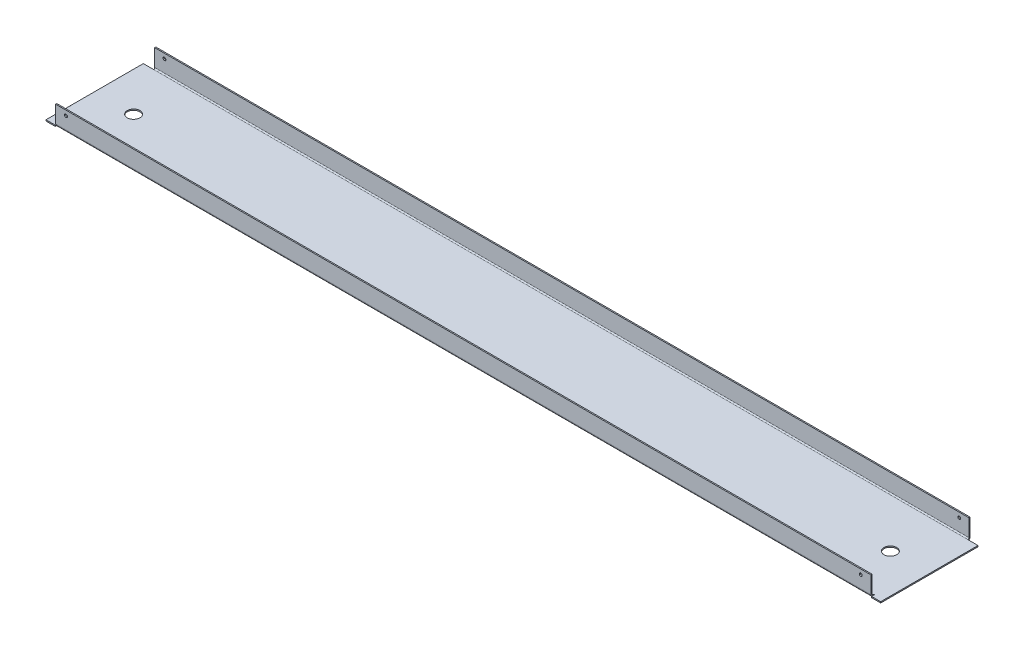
ISO-10303-21;
HEADER;
FILE_DESCRIPTION(('STEP AP214'),'2;1');
FILE_NAME('part.step','',(''),(''),'','','');
FILE_SCHEMA(('AUTOMOTIVE_DESIGN { 1 0 10303 214 1 1 1 1 }'));
ENDSEC;
DATA;
#1=APPLICATION_CONTEXT('core data for automotive mechanical design processes');
#2=APPLICATION_PROTOCOL_DEFINITION('international standard','automotive_design',2000,#1);
#3=PRODUCT_CONTEXT('',#1,'mechanical');
#4=PRODUCT('Part','Part','',(#3));
#5=PRODUCT_RELATED_PRODUCT_CATEGORY('part','',(#4));
#6=PRODUCT_DEFINITION_FORMATION('','',#4);
#7=PRODUCT_DEFINITION_CONTEXT('part definition',#1,'design');
#8=PRODUCT_DEFINITION('design','',#6,#7);
#9=PRODUCT_DEFINITION_SHAPE('','',#8);
#10=(LENGTH_UNIT() NAMED_UNIT(*) SI_UNIT(.MILLI.,.METRE.));
#11=(NAMED_UNIT(*) PLANE_ANGLE_UNIT() SI_UNIT($,.RADIAN.));
#12=(NAMED_UNIT(*) SI_UNIT($,.STERADIAN.) SOLID_ANGLE_UNIT());
#13=UNCERTAINTY_MEASURE_WITH_UNIT(LENGTH_MEASURE(1.E-05),#10,'distance_accuracy_value','');
#14=(GEOMETRIC_REPRESENTATION_CONTEXT(3) GLOBAL_UNCERTAINTY_ASSIGNED_CONTEXT((#13)) GLOBAL_UNIT_ASSIGNED_CONTEXT((#10,
#11,#12)) REPRESENTATION_CONTEXT('',''));
#15=CARTESIAN_POINT('',(0.,0.,0.));
#16=DIRECTION('',(0.,0.,1.));
#17=DIRECTION('',(1.,0.,0.));
#18=AXIS2_PLACEMENT_3D('',#15,#16,#17);
#19=CARTESIAN_POINT('',(0.,-334.3,-1.10551784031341E-12));
#20=DIRECTION('',(0.,1.,0.));
#21=DIRECTION('',(0.,0.,1.));
#22=AXIS2_PLACEMENT_3D('',#19,#20,#21);
#23=PLANE('',#22);
#24=CARTESIAN_POINT('',(388.5,-334.3,52.3499999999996));
#25=DIRECTION('',(0.,-1.,0.));
#26=DIRECTION('',(0.,0.,-1.));
#27=AXIS2_PLACEMENT_3D('',#24,#25,#26);
#28=CIRCLE('',#27,6.50000000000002);
#29=CARTESIAN_POINT('',(388.5,-334.3,45.8499999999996));
#30=VERTEX_POINT('',#29);
#31=EDGE_CURVE('E874',#30,#30,#28,.T.);
#32=ORIENTED_EDGE('',*,*,#31,.F.);
#33=EDGE_LOOP('',(#32));
#34=FACE_BOUND('',#33,.T.);
#35=CARTESIAN_POINT('',(-388.5,-334.3,52.3499999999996));
#36=DIRECTION('',(0.,-1.,0.));
#37=DIRECTION('',(0.,0.,-1.));
#38=AXIS2_PLACEMENT_3D('',#35,#36,#37);
#39=CIRCLE('',#38,6.50000000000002);
#40=CARTESIAN_POINT('',(-388.5,-334.3,45.8499999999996));
#41=VERTEX_POINT('',#40);
#42=EDGE_CURVE('E879',#41,#41,#39,.T.);
#43=ORIENTED_EDGE('',*,*,#42,.F.);
#44=EDGE_LOOP('',(#43));
#45=FACE_BOUND('',#44,.T.);
#46=DIRECTION('',(0.,0.,1.));
#47=VECTOR('',#46,1.);
#48=CARTESIAN_POINT('',(419.1,-334.3,-1.10551784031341E-12));
#49=LINE('',#48,#47);
#50=CARTESIAN_POINT('',(419.1,-334.3,99.3));
#51=VERTEX_POINT('',#50);
#52=CARTESIAN_POINT('',(419.1,-334.3,102.3));
#53=VERTEX_POINT('',#52);
#54=EDGE_CURVE('E94',#51,#53,#49,.T.);
#55=ORIENTED_EDGE('',*,*,#54,.F.);
#56=DIRECTION('',(1.,0.,0.));
#57=VECTOR('',#56,1.);
#58=CARTESIAN_POINT('',(0.,-334.3,99.3));
#59=LINE('',#58,#57);
#60=CARTESIAN_POINT('',(418.5,-334.3,99.3));
#61=VERTEX_POINT('',#60);
#62=EDGE_CURVE('E98',#61,#51,#59,.T.);
#63=ORIENTED_EDGE('',*,*,#62,.F.);
#64=DIRECTION('',(0.,0.,-1.));
#65=VECTOR('',#64,1.);
#66=CARTESIAN_POINT('',(418.5,-334.3,-1.10551784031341E-12));
#67=LINE('',#66,#65);
#68=CARTESIAN_POINT('',(418.5,-334.300000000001,99.9));
#69=VERTEX_POINT('',#68);
#70=EDGE_CURVE('E343',#69,#61,#67,.T.);
#71=ORIENTED_EDGE('',*,*,#70,.F.);
#72=DIRECTION('',(1.,0.,0.));
#73=VECTOR('',#72,1.);
#74=CARTESIAN_POINT('',(418.5,-334.300000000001,99.9));
#75=LINE('',#74,#73);
#76=CARTESIAN_POINT('',(-418.5,-334.3,99.9));
#77=VERTEX_POINT('',#76);
#78=EDGE_CURVE('E235',#69,#77,#75,.F.);
#79=ORIENTED_EDGE('',*,*,#78,.T.);
#80=DIRECTION('',(0.,0.,1.));
#81=VECTOR('',#80,1.);
#82=CARTESIAN_POINT('',(-418.5,-334.3,-1.10551784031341E-12));
#83=LINE('',#82,#81);
#84=CARTESIAN_POINT('',(-418.5,-334.3,99.3));
#85=VERTEX_POINT('',#84);
#86=EDGE_CURVE('E340',#85,#77,#83,.T.);
#87=ORIENTED_EDGE('',*,*,#86,.F.);
#88=DIRECTION('',(1.,0.,0.));
#89=VECTOR('',#88,1.);
#90=CARTESIAN_POINT('',(0.,-334.3,99.3));
#91=LINE('',#90,#89);
#92=CARTESIAN_POINT('',(-419.1,-334.3,99.3));
#93=VERTEX_POINT('',#92);
#94=EDGE_CURVE('E337',#93,#85,#91,.T.);
#95=ORIENTED_EDGE('',*,*,#94,.F.);
#96=DIRECTION('',(0.,0.,-1.));
#97=VECTOR('',#96,1.);
#98=CARTESIAN_POINT('',(-419.1,-334.3,-1.10551784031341E-12));
#99=LINE('',#98,#97);
#100=CARTESIAN_POINT('',(-419.1,-334.3,102.3));
#101=VERTEX_POINT('',#100);
#102=EDGE_CURVE('E302',#101,#93,#99,.T.);
#103=ORIENTED_EDGE('',*,*,#102,.F.);
#104=DIRECTION('',(-1.,0.,0.));
#105=VECTOR('',#104,1.);
#106=CARTESIAN_POINT('',(0.,-334.3,102.3));
#107=LINE('',#106,#105);
#108=CARTESIAN_POINT('',(-428.5,-334.3,102.3));
#109=VERTEX_POINT('',#108);
#110=EDGE_CURVE('E356',#101,#109,#107,.T.);
#111=ORIENTED_EDGE('',*,*,#110,.T.);
#112=DIRECTION('',(0.,0.,-1.));
#113=VECTOR('',#112,1.);
#114=CARTESIAN_POINT('',(-428.5,-334.3,-1.10551784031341E-12));
#115=LINE('',#114,#113);
#116=CARTESIAN_POINT('',(-428.5,-334.3,2.39999999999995));
#117=VERTEX_POINT('',#116);
#118=EDGE_CURVE('E359',#109,#117,#115,.T.);
#119=ORIENTED_EDGE('',*,*,#118,.T.);
#120=DIRECTION('',(1.,0.,0.));
#121=VECTOR('',#120,1.);
#122=CARTESIAN_POINT('',(-428.5,-334.3,2.39999999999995));
#123=LINE('',#122,#121);
#124=CARTESIAN_POINT('',(-418.,-334.3,2.39999999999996));
#125=VERTEX_POINT('',#124);
#126=EDGE_CURVE('E374',#125,#117,#123,.F.);
#127=ORIENTED_EDGE('',*,*,#126,.F.);
#128=DIRECTION('',(1.,0.,0.));
#129=VECTOR('',#128,1.);
#130=CARTESIAN_POINT('',(418.,-334.3,2.40000000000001));
#131=LINE('',#130,#129);
#132=CARTESIAN_POINT('',(418.,-334.3,2.40000000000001));
#133=VERTEX_POINT('',#132);
#134=EDGE_CURVE('E389',#125,#133,#131,.T.);
#135=ORIENTED_EDGE('',*,*,#134,.T.);
#136=CARTESIAN_POINT('',(428.5,-334.3,2.40000000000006));
#137=VERTEX_POINT('',#136);
#138=EDGE_CURVE('E371',#137,#133,#123,.F.);
#139=ORIENTED_EDGE('',*,*,#138,.F.);
#140=DIRECTION('',(0.,0.,1.));
#141=VECTOR('',#140,1.);
#142=CARTESIAN_POINT('',(428.5,-334.3,-1.10551784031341E-12));
#143=LINE('',#142,#141);
#144=CARTESIAN_POINT('',(428.5,-334.3,102.3));
#145=VERTEX_POINT('',#144);
#146=EDGE_CURVE('E357',#137,#145,#143,.T.);
#147=ORIENTED_EDGE('',*,*,#146,.T.);
#148=EDGE_CURVE('E354',#145,#53,#107,.T.);
#149=ORIENTED_EDGE('',*,*,#148,.T.);
#150=EDGE_LOOP('',(#55,#63,#71,#79,#87,#95,#103,#111,#119,#127,#135,#139,#147,#149));
#151=FACE_BOUND('',#150,.T.);
#152=ADVANCED_FACE('F77',(#34,#45,#151),#23,.F.);
#153=CARTESIAN_POINT('',(0.,-333.1,-1.10132806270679E-12));
#154=DIRECTION('',(0.,1.,0.));
#155=DIRECTION('',(0.,0.,1.));
#156=AXIS2_PLACEMENT_3D('',#153,#154,#155);
#157=PLANE('',#156);
#158=CARTESIAN_POINT('',(388.5,-333.1,52.3499999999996));
#159=DIRECTION('',(0.,-1.,0.));
#160=DIRECTION('',(0.,0.,-1.));
#161=AXIS2_PLACEMENT_3D('',#158,#159,#160);
#162=CIRCLE('',#161,6.50000000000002);
#163=CARTESIAN_POINT('',(388.5,-333.1,45.8499999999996));
#164=VERTEX_POINT('',#163);
#165=EDGE_CURVE('E449',#164,#164,#162,.T.);
#166=ORIENTED_EDGE('',*,*,#165,.T.);
#167=EDGE_LOOP('',(#166));
#168=FACE_BOUND('',#167,.T.);
#169=CARTESIAN_POINT('',(-388.5,-333.1,52.3499999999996));
#170=DIRECTION('',(0.,-1.,0.));
#171=DIRECTION('',(0.,0.,-1.));
#172=AXIS2_PLACEMENT_3D('',#169,#170,#171);
#173=CIRCLE('',#172,6.50000000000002);
#174=CARTESIAN_POINT('',(-388.5,-333.1,45.8499999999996));
#175=VERTEX_POINT('',#174);
#176=EDGE_CURVE('E875',#175,#175,#173,.T.);
#177=ORIENTED_EDGE('',*,*,#176,.T.);
#178=EDGE_LOOP('',(#177));
#179=FACE_BOUND('',#178,.T.);
#180=DIRECTION('',(-1.,0.,0.));
#181=VECTOR('',#180,1.);
#182=CARTESIAN_POINT('',(419.1,-333.100000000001,99.3));
#183=LINE('',#182,#181);
#184=CARTESIAN_POINT('',(419.1,-333.1,99.3));
#185=VERTEX_POINT('',#184);
#186=CARTESIAN_POINT('',(418.5,-333.1,99.3));
#187=VERTEX_POINT('',#186);
#188=EDGE_CURVE('E304',#185,#187,#183,.T.);
#189=ORIENTED_EDGE('',*,*,#188,.F.);
#190=DIRECTION('',(0.,0.,-1.));
#191=VECTOR('',#190,1.);
#192=CARTESIAN_POINT('',(419.1,-333.1,102.3));
#193=LINE('',#192,#191);
#194=CARTESIAN_POINT('',(419.1,-333.1,102.3));
#195=VERTEX_POINT('',#194);
#196=EDGE_CURVE('E299',#195,#185,#193,.T.);
#197=ORIENTED_EDGE('',*,*,#196,.F.);
#198=DIRECTION('',(1.,0.,0.));
#199=VECTOR('',#198,1.);
#200=CARTESIAN_POINT('',(-428.5,-333.1,102.3));
#201=LINE('',#200,#199);
#202=CARTESIAN_POINT('',(428.5,-333.1,102.3));
#203=VERTEX_POINT('',#202);
#204=EDGE_CURVE('E362',#203,#195,#201,.F.);
#205=ORIENTED_EDGE('',*,*,#204,.F.);
#206=DIRECTION('',(0.,0.,-1.));
#207=VECTOR('',#206,1.);
#208=CARTESIAN_POINT('',(428.5,-333.1,102.3));
#209=LINE('',#208,#207);
#210=CARTESIAN_POINT('',(428.5,-333.1,2.40000000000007));
#211=VERTEX_POINT('',#210);
#212=EDGE_CURVE('E366',#211,#203,#209,.F.);
#213=ORIENTED_EDGE('',*,*,#212,.F.);
#214=DIRECTION('',(1.,0.,0.));
#215=VECTOR('',#214,1.);
#216=CARTESIAN_POINT('',(-428.5,-333.1,2.39999999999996));
#217=LINE('',#216,#215);
#218=CARTESIAN_POINT('',(418.,-333.1,2.40000000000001));
#219=VERTEX_POINT('',#218);
#220=EDGE_CURVE('E380',#219,#211,#217,.T.);
#221=ORIENTED_EDGE('',*,*,#220,.F.);
#222=DIRECTION('',(1.,0.,0.));
#223=VECTOR('',#222,1.);
#224=CARTESIAN_POINT('',(418.,-333.1,2.40000000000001));
#225=LINE('',#224,#223);
#226=CARTESIAN_POINT('',(-418.,-333.1,2.40000000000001));
#227=VERTEX_POINT('',#226);
#228=EDGE_CURVE('E350',#227,#219,#225,.T.);
#229=ORIENTED_EDGE('',*,*,#228,.F.);
#230=CARTESIAN_POINT('',(-428.5,-333.1,2.39999999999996));
#231=VERTEX_POINT('',#230);
#232=EDGE_CURVE('E377',#231,#227,#217,.T.);
#233=ORIENTED_EDGE('',*,*,#232,.F.);
#234=DIRECTION('',(0.,0.,1.));
#235=VECTOR('',#234,1.);
#236=CARTESIAN_POINT('',(-428.5,-333.1,1.2));
#237=LINE('',#236,#235);
#238=CARTESIAN_POINT('',(-428.5,-333.1,102.3));
#239=VERTEX_POINT('',#238);
#240=EDGE_CURVE('E368',#239,#231,#237,.F.);
#241=ORIENTED_EDGE('',*,*,#240,.F.);
#242=CARTESIAN_POINT('',(-419.1,-333.1,102.3));
#243=VERTEX_POINT('',#242);
#244=EDGE_CURVE('E365',#243,#239,#201,.F.);
#245=ORIENTED_EDGE('',*,*,#244,.F.);
#246=DIRECTION('',(0.,0.,1.));
#247=VECTOR('',#246,1.);
#248=CARTESIAN_POINT('',(-419.1,-333.100000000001,99.3));
#249=LINE('',#248,#247);
#250=CARTESIAN_POINT('',(-419.1,-333.1,99.3));
#251=VERTEX_POINT('',#250);
#252=EDGE_CURVE('E319',#251,#243,#249,.T.);
#253=ORIENTED_EDGE('',*,*,#252,.F.);
#254=DIRECTION('',(-1.,0.,0.));
#255=VECTOR('',#254,1.);
#256=CARTESIAN_POINT('',(-418.5,-333.100000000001,99.3));
#257=LINE('',#256,#255);
#258=CARTESIAN_POINT('',(-418.5,-333.1,99.3));
#259=VERTEX_POINT('',#258);
#260=EDGE_CURVE('E315',#259,#251,#257,.T.);
#261=ORIENTED_EDGE('',*,*,#260,.F.);
#262=DIRECTION('',(0.,0.,-1.));
#263=VECTOR('',#262,1.);
#264=CARTESIAN_POINT('',(-418.5,-333.100000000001,99.9));
#265=LINE('',#264,#263);
#266=CARTESIAN_POINT('',(-418.5,-333.1,99.9));
#267=VERTEX_POINT('',#266);
#268=EDGE_CURVE('E312',#267,#259,#265,.T.);
#269=ORIENTED_EDGE('',*,*,#268,.F.);
#270=DIRECTION('',(1.,0.,0.));
#271=VECTOR('',#270,1.);
#272=CARTESIAN_POINT('',(418.5,-333.100000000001,99.9));
#273=LINE('',#272,#271);
#274=CARTESIAN_POINT('',(418.5,-333.1,99.9));
#275=VERTEX_POINT('',#274);
#276=EDGE_CURVE('E290',#275,#267,#273,.F.);
#277=ORIENTED_EDGE('',*,*,#276,.F.);
#278=DIRECTION('',(0.,0.,1.));
#279=VECTOR('',#278,1.);
#280=CARTESIAN_POINT('',(418.5,-333.100000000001,99.3));
#281=LINE('',#280,#279);
#282=EDGE_CURVE('E308',#187,#275,#281,.T.);
#283=ORIENTED_EDGE('',*,*,#282,.F.);
#284=EDGE_LOOP('',(#189,#197,#205,#213,#221,#229,#233,#241,#245,#253,#261,#269,#277,#283));
#285=FACE_BOUND('',#284,.T.);
#286=ADVANCED_FACE('F469',(#168,#179,#285),#157,.T.);
#287=CARTESIAN_POINT('',(-428.5,-334.3,102.3));
#288=DIRECTION('',(0.,0.,-1.));
#289=DIRECTION('',(0.,1.,0.));
#290=AXIS2_PLACEMENT_3D('',#287,#288,#289);
#291=PLANE('',#290);
#292=DIRECTION('',(0.,-1.,0.));
#293=VECTOR('',#292,1.);
#294=CARTESIAN_POINT('',(419.1,-333.1,102.3));
#295=LINE('',#294,#293);
#296=EDGE_CURVE('E303',#195,#53,#295,.T.);
#297=ORIENTED_EDGE('',*,*,#296,.T.);
#298=ORIENTED_EDGE('',*,*,#148,.F.);
#299=DIRECTION('',(0.,1.,0.));
#300=VECTOR('',#299,1.);
#301=CARTESIAN_POINT('',(428.5,-334.3,102.3));
#302=LINE('',#301,#300);
#303=EDGE_CURVE('E347',#145,#203,#302,.T.);
#304=ORIENTED_EDGE('',*,*,#303,.T.);
#305=ORIENTED_EDGE('',*,*,#204,.T.);
#306=EDGE_LOOP('',(#297,#298,#304,#305));
#307=FACE_BOUND('',#306,.T.);
#308=ADVANCED_FACE('F482',(#307),#291,.F.);
#309=DIRECTION('',(0.,-1.,0.));
#310=VECTOR('',#309,1.);
#311=CARTESIAN_POINT('',(-419.1,-333.1,102.3));
#312=LINE('',#311,#310);
#313=EDGE_CURVE('E322',#243,#101,#312,.T.);
#314=ORIENTED_EDGE('',*,*,#313,.F.);
#315=ORIENTED_EDGE('',*,*,#244,.T.);
#316=DIRECTION('',(0.,1.,0.));
#317=VECTOR('',#316,1.);
#318=CARTESIAN_POINT('',(-428.5,-334.3,102.3));
#319=LINE('',#318,#317);
#320=EDGE_CURVE('E351',#109,#239,#319,.T.);
#321=ORIENTED_EDGE('',*,*,#320,.F.);
#322=ORIENTED_EDGE('',*,*,#110,.F.);
#323=EDGE_LOOP('',(#314,#315,#321,#322));
#324=FACE_BOUND('',#323,.T.);
#325=ADVANCED_FACE('F515',(#324),#291,.F.);
#326=CARTESIAN_POINT('',(-418.,-314.3,1.2));
#327=DIRECTION('',(1.,0.,0.));
#328=DIRECTION('',(0.,1.,0.));
#329=AXIS2_PLACEMENT_3D('',#326,#327,#328);
#330=PLANE('',#329);
#331=DIRECTION('',(0.,0.,-1.));
#332=VECTOR('',#331,1.);
#333=CARTESIAN_POINT('',(-418.,-331.9,1.20000000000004));
#334=LINE('',#333,#332);
#335=CARTESIAN_POINT('',(-418.,-331.9,1.2));
#336=VERTEX_POINT('',#335);
#337=CARTESIAN_POINT('',(-418.,-331.9,0.));
#338=VERTEX_POINT('',#337);
#339=EDGE_CURVE('E404',#336,#338,#334,.T.);
#340=ORIENTED_EDGE('',*,*,#339,.F.);
#341=DIRECTION('',(0.,-1.,0.));
#342=VECTOR('',#341,1.);
#343=CARTESIAN_POINT('',(-418.,-314.3,1.2));
#344=LINE('',#343,#342);
#345=CARTESIAN_POINT('',(-418.,-314.3,1.2));
#346=VERTEX_POINT('',#345);
#347=EDGE_CURVE('E414',#346,#336,#344,.T.);
#348=ORIENTED_EDGE('',*,*,#347,.F.);
#349=DIRECTION('',(0.,0.,-1.));
#350=VECTOR('',#349,1.);
#351=CARTESIAN_POINT('',(-418.,-314.3,1.2));
#352=LINE('',#351,#350);
#353=CARTESIAN_POINT('',(-418.,-314.3,0.));
#354=VERTEX_POINT('',#353);
#355=EDGE_CURVE('E86',#346,#354,#352,.T.);
#356=ORIENTED_EDGE('',*,*,#355,.T.);
#357=DIRECTION('',(0.,-1.,0.));
#358=VECTOR('',#357,1.);
#359=CARTESIAN_POINT('',(-418.,-314.3,0.));
#360=LINE('',#359,#358);
#361=EDGE_CURVE('E412',#354,#338,#360,.T.);
#362=ORIENTED_EDGE('',*,*,#361,.T.);
#363=EDGE_LOOP('',(#340,#348,#356,#362));
#364=FACE_BOUND('',#363,.T.);
#365=ADVANCED_FACE('F79',(#364),#330,.F.);
#366=CARTESIAN_POINT('',(418.,-314.3,1.2));
#367=DIRECTION('',(-1.,0.,0.));
#368=DIRECTION('',(0.,0.,1.));
#369=AXIS2_PLACEMENT_3D('',#366,#367,#368);
#370=PLANE('',#369);
#371=DIRECTION('',(0.,0.,-1.));
#372=VECTOR('',#371,1.);
#373=CARTESIAN_POINT('',(418.,-331.9,1.20000000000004));
#374=LINE('',#373,#372);
#375=CARTESIAN_POINT('',(418.,-331.9,1.2));
#376=VERTEX_POINT('',#375);
#377=CARTESIAN_POINT('',(418.,-331.9,0.));
#378=VERTEX_POINT('',#377);
#379=EDGE_CURVE('E388',#376,#378,#374,.T.);
#380=ORIENTED_EDGE('',*,*,#379,.T.);
#381=DIRECTION('',(0.,1.,0.));
#382=VECTOR('',#381,1.);
#383=CARTESIAN_POINT('',(418.,-314.3,0.));
#384=LINE('',#383,#382);
#385=CARTESIAN_POINT('',(418.,-314.3,0.));
#386=VERTEX_POINT('',#385);
#387=EDGE_CURVE('E424',#378,#386,#384,.T.);
#388=ORIENTED_EDGE('',*,*,#387,.T.);
#389=DIRECTION('',(0.,0.,-1.));
#390=VECTOR('',#389,1.);
#391=CARTESIAN_POINT('',(418.,-314.3,1.2));
#392=LINE('',#391,#390);
#393=CARTESIAN_POINT('',(418.,-314.3,1.2));
#394=VERTEX_POINT('',#393);
#395=EDGE_CURVE('E13',#394,#386,#392,.T.);
#396=ORIENTED_EDGE('',*,*,#395,.F.);
#397=DIRECTION('',(0.,1.,0.));
#398=VECTOR('',#397,1.);
#399=CARTESIAN_POINT('',(418.,-314.3,1.2));
#400=LINE('',#399,#398);
#401=EDGE_CURVE('E417',#376,#394,#400,.T.);
#402=ORIENTED_EDGE('',*,*,#401,.F.);
#403=EDGE_LOOP('',(#380,#388,#396,#402));
#404=FACE_BOUND('',#403,.T.);
#405=ADVANCED_FACE('F546',(#404),#370,.F.);
#406=CARTESIAN_POINT('',(0.,0.,1.2));
#407=DIRECTION('',(0.,0.,1.));
#408=DIRECTION('',(1.,0.,0.));
#409=AXIS2_PLACEMENT_3D('',#406,#407,#408);
#410=PLANE('',#409);
#411=CARTESIAN_POINT('',(-408.,-319.3,1.2));
#412=DIRECTION('',(0.,0.,1.));
#413=DIRECTION('',(1.,0.,0.));
#414=AXIS2_PLACEMENT_3D('',#411,#412,#413);
#415=CIRCLE('',#414,1.50000000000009);
#416=CARTESIAN_POINT('',(-406.5,-319.3,1.2));
#417=VERTEX_POINT('',#416);
#418=EDGE_CURVE('E283',#417,#417,#415,.T.);
#419=ORIENTED_EDGE('',*,*,#418,.F.);
#420=EDGE_LOOP('',(#419));
#421=FACE_BOUND('',#420,.T.);
#422=CARTESIAN_POINT('',(408.,-319.3,1.2));
#423=DIRECTION('',(0.,0.,1.));
#424=DIRECTION('',(1.,0.,0.));
#425=AXIS2_PLACEMENT_3D('',#422,#423,#424);
#426=CIRCLE('',#425,1.50000000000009);
#427=CARTESIAN_POINT('',(409.5,-319.3,1.2));
#428=VERTEX_POINT('',#427);
#429=EDGE_CURVE('E430',#428,#428,#426,.T.);
#430=ORIENTED_EDGE('',*,*,#429,.F.);
#431=EDGE_LOOP('',(#430));
#432=FACE_BOUND('',#431,.T.);
#433=ORIENTED_EDGE('',*,*,#347,.T.);
#434=DIRECTION('',(1.,0.,0.));
#435=VECTOR('',#434,1.);
#436=CARTESIAN_POINT('',(418.,-331.9,1.20000000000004));
#437=LINE('',#436,#435);
#438=EDGE_CURVE('E397',#376,#336,#437,.F.);
#439=ORIENTED_EDGE('',*,*,#438,.F.);
#440=ORIENTED_EDGE('',*,*,#401,.T.);
#441=DIRECTION('',(-1.,0.,0.));
#442=VECTOR('',#441,1.);
#443=CARTESIAN_POINT('',(-418.,-314.3,1.2));
#444=LINE('',#443,#442);
#445=EDGE_CURVE('E420',#394,#346,#444,.T.);
#446=ORIENTED_EDGE('',*,*,#445,.T.);
#447=EDGE_LOOP('',(#433,#439,#440,#446));
#448=FACE_BOUND('',#447,.T.);
#449=ADVANCED_FACE('F542',(#421,#432,#448),#410,.T.);
#450=CARTESIAN_POINT('',(0.,0.,0.));
#451=DIRECTION('',(0.,0.,1.));
#452=DIRECTION('',(1.,0.,0.));
#453=AXIS2_PLACEMENT_3D('',#450,#451,#452);
#454=PLANE('',#453);
#455=CARTESIAN_POINT('',(-408.,-319.3,0.));
#456=DIRECTION('',(0.,0.,1.));
#457=DIRECTION('',(1.,0.,0.));
#458=AXIS2_PLACEMENT_3D('',#455,#456,#457);
#459=CIRCLE('',#458,1.50000000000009);
#460=CARTESIAN_POINT('',(-406.5,-319.3,0.));
#461=VERTEX_POINT('',#460);
#462=EDGE_CURVE('E431',#461,#461,#459,.T.);
#463=ORIENTED_EDGE('',*,*,#462,.T.);
#464=EDGE_LOOP('',(#463));
#465=FACE_BOUND('',#464,.T.);
#466=CARTESIAN_POINT('',(408.,-319.3,0.));
#467=DIRECTION('',(0.,0.,1.));
#468=DIRECTION('',(1.,0.,0.));
#469=AXIS2_PLACEMENT_3D('',#466,#467,#468);
#470=CIRCLE('',#469,1.50000000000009);
#471=CARTESIAN_POINT('',(409.5,-319.3,0.));
#472=VERTEX_POINT('',#471);
#473=EDGE_CURVE('E442',#472,#472,#470,.T.);
#474=ORIENTED_EDGE('',*,*,#473,.T.);
#475=EDGE_LOOP('',(#474));
#476=FACE_BOUND('',#475,.T.);
#477=DIRECTION('',(1.,0.,0.));
#478=VECTOR('',#477,1.);
#479=CARTESIAN_POINT('',(418.,-331.9,0.));
#480=LINE('',#479,#478);
#481=EDGE_CURVE('E383',#378,#338,#480,.F.);
#482=ORIENTED_EDGE('',*,*,#481,.T.);
#483=ORIENTED_EDGE('',*,*,#361,.F.);
#484=DIRECTION('',(-1.,0.,0.));
#485=VECTOR('',#484,1.);
#486=CARTESIAN_POINT('',(-418.,-314.3,0.));
#487=LINE('',#486,#485);
#488=EDGE_CURVE('E418',#386,#354,#487,.T.);
#489=ORIENTED_EDGE('',*,*,#488,.F.);
#490=ORIENTED_EDGE('',*,*,#387,.F.);
#491=EDGE_LOOP('',(#482,#483,#489,#490));
#492=FACE_BOUND('',#491,.T.);
#493=ADVANCED_FACE('F545',(#465,#476,#492),#454,.F.);
#494=CARTESIAN_POINT('',(-418.,-314.3,1.2));
#495=DIRECTION('',(0.,-1.,0.));
#496=DIRECTION('',(0.,0.,-1.));
#497=AXIS2_PLACEMENT_3D('',#494,#495,#496);
#498=PLANE('',#497);
#499=ORIENTED_EDGE('',*,*,#488,.T.);
#500=ORIENTED_EDGE('',*,*,#355,.F.);
#501=ORIENTED_EDGE('',*,*,#445,.F.);
#502=ORIENTED_EDGE('',*,*,#395,.T.);
#503=EDGE_LOOP('',(#499,#500,#501,#502));
#504=FACE_BOUND('',#503,.T.);
#505=ADVANCED_FACE('F537',(#504),#498,.F.);
#506=CARTESIAN_POINT('',(-418.,-331.9,2.40000000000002));
#507=DIRECTION('',(-1.,0.,0.));
#508=DIRECTION('',(0.,0.,1.));
#509=AXIS2_PLACEMENT_3D('',#506,#507,#508);
#510=PLANE('',#509);
#511=DIRECTION('',(0.,-1.,0.));
#512=VECTOR('',#511,1.);
#513=CARTESIAN_POINT('',(-418.,-333.1,2.40000000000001));
#514=LINE('',#513,#512);
#515=EDGE_CURVE('E407',#227,#125,#514,.T.);
#516=ORIENTED_EDGE('',*,*,#515,.F.);
#517=CARTESIAN_POINT('',(-418.,-331.9,2.40000000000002));
#518=DIRECTION('',(1.,0.,0.));
#519=DIRECTION('',(0.,0.,-1.));
#520=AXIS2_PLACEMENT_3D('',#517,#518,#519);
#521=CIRCLE('',#520,1.19999999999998);
#522=EDGE_CURVE('E392',#336,#227,#521,.F.);
#523=ORIENTED_EDGE('',*,*,#522,.F.);
#524=ORIENTED_EDGE('',*,*,#339,.T.);
#525=CARTESIAN_POINT('',(-418.,-331.9,2.40000000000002));
#526=DIRECTION('',(1.,0.,0.));
#527=DIRECTION('',(0.,0.,-1.));
#528=AXIS2_PLACEMENT_3D('',#525,#526,#527);
#529=CIRCLE('',#528,2.39999999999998);
#530=EDGE_CURVE('E385',#338,#125,#529,.F.);
#531=ORIENTED_EDGE('',*,*,#530,.T.);
#532=EDGE_LOOP('',(#516,#523,#524,#531));
#533=FACE_BOUND('',#532,.T.);
#534=ADVANCED_FACE('F534',(#533),#510,.T.);
#535=CARTESIAN_POINT('',(418.,-331.9,2.40000000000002));
#536=DIRECTION('',(-1.,0.,0.));
#537=DIRECTION('',(0.,0.,1.));
#538=AXIS2_PLACEMENT_3D('',#535,#536,#537);
#539=PLANE('',#538);
#540=CARTESIAN_POINT('',(418.,-331.9,2.40000000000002));
#541=DIRECTION('',(1.,0.,0.));
#542=DIRECTION('',(0.,0.,-1.));
#543=AXIS2_PLACEMENT_3D('',#540,#541,#542);
#544=CIRCLE('',#543,1.19999999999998);
#545=EDGE_CURVE('E400',#219,#376,#544,.T.);
#546=ORIENTED_EDGE('',*,*,#545,.F.);
#547=DIRECTION('',(0.,-1.,0.));
#548=VECTOR('',#547,1.);
#549=CARTESIAN_POINT('',(418.,-333.1,2.40000000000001));
#550=LINE('',#549,#548);
#551=EDGE_CURVE('E410',#219,#133,#550,.T.);
#552=ORIENTED_EDGE('',*,*,#551,.T.);
#553=CARTESIAN_POINT('',(418.,-331.9,2.40000000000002));
#554=DIRECTION('',(1.,0.,0.));
#555=DIRECTION('',(0.,0.,-1.));
#556=AXIS2_PLACEMENT_3D('',#553,#554,#555);
#557=CIRCLE('',#556,2.39999999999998);
#558=EDGE_CURVE('E386',#133,#378,#557,.T.);
#559=ORIENTED_EDGE('',*,*,#558,.T.);
#560=ORIENTED_EDGE('',*,*,#379,.F.);
#561=EDGE_LOOP('',(#546,#552,#559,#560));
#562=FACE_BOUND('',#561,.T.);
#563=ADVANCED_FACE('F529',(#562),#539,.F.);
#564=CARTESIAN_POINT('',(418.,-331.9,2.40000000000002));
#565=DIRECTION('',(1.,0.,0.));
#566=DIRECTION('',(0.,-1.,0.));
#567=AXIS2_PLACEMENT_3D('',#564,#565,#566);
#568=CYLINDRICAL_SURFACE('',#567,2.39999999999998);
#569=ORIENTED_EDGE('',*,*,#481,.F.);
#570=ORIENTED_EDGE('',*,*,#558,.F.);
#571=ORIENTED_EDGE('',*,*,#134,.F.);
#572=ORIENTED_EDGE('',*,*,#530,.F.);
#573=EDGE_LOOP('',(#569,#570,#571,#572));
#574=FACE_BOUND('',#573,.T.);
#575=ADVANCED_FACE('F525',(#574),#568,.T.);
#576=CARTESIAN_POINT('',(418.,-331.9,2.40000000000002));
#577=DIRECTION('',(1.,0.,0.));
#578=DIRECTION('',(0.,-1.,0.));
#579=AXIS2_PLACEMENT_3D('',#576,#577,#578);
#580=CYLINDRICAL_SURFACE('',#579,1.19999999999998);
#581=ORIENTED_EDGE('',*,*,#438,.T.);
#582=ORIENTED_EDGE('',*,*,#522,.T.);
#583=ORIENTED_EDGE('',*,*,#228,.T.);
#584=ORIENTED_EDGE('',*,*,#545,.T.);
#585=EDGE_LOOP('',(#581,#582,#583,#584));
#586=FACE_BOUND('',#585,.T.);
#587=ADVANCED_FACE('F528',(#586),#580,.F.);
#588=CARTESIAN_POINT('',(-428.5,-333.1,2.39999999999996));
#589=DIRECTION('',(0.,0.,-1.));
#590=DIRECTION('',(0.,1.,0.));
#591=AXIS2_PLACEMENT_3D('',#588,#589,#590);
#592=PLANE('',#591);
#593=ORIENTED_EDGE('',*,*,#551,.F.);
#594=ORIENTED_EDGE('',*,*,#220,.T.);
#595=DIRECTION('',(0.,1.,0.));
#596=VECTOR('',#595,1.);
#597=CARTESIAN_POINT('',(428.5,-333.1,2.40000000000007));
#598=LINE('',#597,#596);
#599=EDGE_CURVE('E375',#211,#137,#598,.F.);
#600=ORIENTED_EDGE('',*,*,#599,.T.);
#601=ORIENTED_EDGE('',*,*,#138,.T.);
#602=EDGE_LOOP('',(#593,#594,#600,#601));
#603=FACE_BOUND('',#602,.T.);
#604=ADVANCED_FACE('F523',(#603),#592,.T.);
#605=CARTESIAN_POINT('',(-428.5,-334.3,1.2));
#606=DIRECTION('',(1.,0.,0.));
#607=DIRECTION('',(0.,0.,-1.));
#608=AXIS2_PLACEMENT_3D('',#605,#606,#607);
#609=PLANE('',#608);
#610=DIRECTION('',(0.,1.,0.));
#611=VECTOR('',#610,1.);
#612=CARTESIAN_POINT('',(-428.5,-334.3,2.39999999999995));
#613=LINE('',#612,#611);
#614=EDGE_CURVE('E346',#231,#117,#613,.F.);
#615=ORIENTED_EDGE('',*,*,#614,.T.);
#616=ORIENTED_EDGE('',*,*,#118,.F.);
#617=ORIENTED_EDGE('',*,*,#320,.T.);
#618=ORIENTED_EDGE('',*,*,#240,.T.);
#619=EDGE_LOOP('',(#615,#616,#617,#618));
#620=FACE_BOUND('',#619,.T.);
#621=ADVANCED_FACE('F519',(#620),#609,.F.);
#622=CARTESIAN_POINT('',(428.5,-334.3,102.3));
#623=DIRECTION('',(-1.,0.,0.));
#624=DIRECTION('',(0.,0.,1.));
#625=AXIS2_PLACEMENT_3D('',#622,#623,#624);
#626=PLANE('',#625);
#627=ORIENTED_EDGE('',*,*,#599,.F.);
#628=ORIENTED_EDGE('',*,*,#212,.T.);
#629=ORIENTED_EDGE('',*,*,#303,.F.);
#630=ORIENTED_EDGE('',*,*,#146,.F.);
#631=EDGE_LOOP('',(#627,#628,#629,#630));
#632=FACE_BOUND('',#631,.T.);
#633=ADVANCED_FACE('F516',(#632),#626,.F.);
#634=ORIENTED_EDGE('',*,*,#232,.T.);
#635=ORIENTED_EDGE('',*,*,#515,.T.);
#636=ORIENTED_EDGE('',*,*,#126,.T.);
#637=ORIENTED_EDGE('',*,*,#614,.F.);
#638=EDGE_LOOP('',(#634,#635,#636,#637));
#639=FACE_BOUND('',#638,.T.);
#640=ADVANCED_FACE('F511',(#639),#592,.T.);
#641=CARTESIAN_POINT('',(419.1,-333.100000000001,99.3));
#642=DIRECTION('',(0.,0.,1.));
#643=DIRECTION('',(0.,-1.,0.));
#644=AXIS2_PLACEMENT_3D('',#641,#642,#643);
#645=PLANE('',#644);
#646=DIRECTION('',(0.,-1.,0.));
#647=VECTOR('',#646,1.);
#648=CARTESIAN_POINT('',(418.5,-333.100000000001,99.3));
#649=LINE('',#648,#647);
#650=EDGE_CURVE('E311',#187,#61,#649,.T.);
#651=ORIENTED_EDGE('',*,*,#650,.T.);
#652=ORIENTED_EDGE('',*,*,#62,.T.);
#653=DIRECTION('',(0.,-1.,0.));
#654=VECTOR('',#653,1.);
#655=CARTESIAN_POINT('',(419.1,-333.100000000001,99.3));
#656=LINE('',#655,#654);
#657=EDGE_CURVE('E307',#185,#51,#656,.T.);
#658=ORIENTED_EDGE('',*,*,#657,.F.);
#659=ORIENTED_EDGE('',*,*,#188,.T.);
#660=EDGE_LOOP('',(#651,#652,#658,#659));
#661=FACE_BOUND('',#660,.T.);
#662=ADVANCED_FACE('F476',(#661),#645,.T.);
#663=CARTESIAN_POINT('',(418.5,-333.100000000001,99.3));
#664=DIRECTION('',(1.,0.,0.));
#665=DIRECTION('',(0.,0.,-1.));
#666=AXIS2_PLACEMENT_3D('',#663,#664,#665);
#667=PLANE('',#666);
#668=DIRECTION('',(0.,-1.,0.));
#669=VECTOR('',#668,1.);
#670=CARTESIAN_POINT('',(418.5,-333.100000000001,99.9));
#671=LINE('',#670,#669);
#672=EDGE_CURVE('E286',#275,#69,#671,.T.);
#673=ORIENTED_EDGE('',*,*,#672,.T.);
#674=ORIENTED_EDGE('',*,*,#70,.T.);
#675=ORIENTED_EDGE('',*,*,#650,.F.);
#676=ORIENTED_EDGE('',*,*,#282,.T.);
#677=EDGE_LOOP('',(#673,#674,#675,#676));
#678=FACE_BOUND('',#677,.T.);
#679=ADVANCED_FACE('F473',(#678),#667,.T.);
#680=CARTESIAN_POINT('',(-418.5,-333.100000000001,99.9));
#681=DIRECTION('',(-1.,0.,0.));
#682=DIRECTION('',(0.,0.,1.));
#683=AXIS2_PLACEMENT_3D('',#680,#681,#682);
#684=PLANE('',#683);
#685=DIRECTION('',(0.,-1.,0.));
#686=VECTOR('',#685,1.);
#687=CARTESIAN_POINT('',(-418.5,-333.100000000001,99.3));
#688=LINE('',#687,#686);
#689=EDGE_CURVE('E318',#259,#85,#688,.T.);
#690=ORIENTED_EDGE('',*,*,#689,.T.);
#691=ORIENTED_EDGE('',*,*,#86,.T.);
#692=DIRECTION('',(-1.85037170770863E-13,-1.,0.));
#693=VECTOR('',#692,1.);
#694=CARTESIAN_POINT('',(-418.5,-333.100000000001,99.9));
#695=LINE('',#694,#693);
#696=EDGE_CURVE('E294',#267,#77,#695,.T.);
#697=ORIENTED_EDGE('',*,*,#696,.F.);
#698=ORIENTED_EDGE('',*,*,#268,.T.);
#699=EDGE_LOOP('',(#690,#691,#697,#698));
#700=FACE_BOUND('',#699,.T.);
#701=ADVANCED_FACE('F496',(#700),#684,.T.);
#702=CARTESIAN_POINT('',(-418.5,-333.100000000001,99.3));
#703=DIRECTION('',(0.,0.,1.));
#704=DIRECTION('',(0.,-1.,0.));
#705=AXIS2_PLACEMENT_3D('',#702,#703,#704);
#706=PLANE('',#705);
#707=DIRECTION('',(0.,-1.,0.));
#708=VECTOR('',#707,1.);
#709=CARTESIAN_POINT('',(-419.1,-333.100000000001,99.3));
#710=LINE('',#709,#708);
#711=EDGE_CURVE('E297',#251,#93,#710,.T.);
#712=ORIENTED_EDGE('',*,*,#711,.T.);
#713=ORIENTED_EDGE('',*,*,#94,.T.);
#714=ORIENTED_EDGE('',*,*,#689,.F.);
#715=ORIENTED_EDGE('',*,*,#260,.T.);
#716=EDGE_LOOP('',(#712,#713,#714,#715));
#717=FACE_BOUND('',#716,.T.);
#718=ADVANCED_FACE('F488',(#717),#706,.T.);
#719=CARTESIAN_POINT('',(419.1,-333.1,102.3));
#720=DIRECTION('',(-1.,0.,0.));
#721=DIRECTION('',(0.,0.,1.));
#722=AXIS2_PLACEMENT_3D('',#719,#720,#721);
#723=PLANE('',#722);
#724=ORIENTED_EDGE('',*,*,#657,.T.);
#725=ORIENTED_EDGE('',*,*,#54,.T.);
#726=ORIENTED_EDGE('',*,*,#296,.F.);
#727=ORIENTED_EDGE('',*,*,#196,.T.);
#728=EDGE_LOOP('',(#724,#725,#726,#727));
#729=FACE_BOUND('',#728,.T.);
#730=ADVANCED_FACE('F485',(#729),#723,.T.);
#731=CARTESIAN_POINT('',(-419.1,-333.100000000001,99.3));
#732=DIRECTION('',(1.,0.,0.));
#733=DIRECTION('',(0.,0.,-1.));
#734=AXIS2_PLACEMENT_3D('',#731,#732,#733);
#735=PLANE('',#734);
#736=ORIENTED_EDGE('',*,*,#313,.T.);
#737=ORIENTED_EDGE('',*,*,#102,.T.);
#738=ORIENTED_EDGE('',*,*,#711,.F.);
#739=ORIENTED_EDGE('',*,*,#252,.T.);
#740=EDGE_LOOP('',(#736,#737,#738,#739));
#741=FACE_BOUND('',#740,.T.);
#742=ADVANCED_FACE('F487',(#741),#735,.T.);
#743=CARTESIAN_POINT('',(-418.5,-331.900000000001,99.9));
#744=DIRECTION('',(-1.,0.,0.));
#745=DIRECTION('',(0.,0.,1.));
#746=AXIS2_PLACEMENT_3D('',#743,#744,#745);
#747=PLANE('',#746);
#748=DIRECTION('',(0.,0.,1.));
#749=VECTOR('',#748,1.);
#750=CARTESIAN_POINT('',(-418.5,-331.9,102.3));
#751=LINE('',#750,#749);
#752=CARTESIAN_POINT('',(-418.5,-331.900000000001,101.1));
#753=VERTEX_POINT('',#752);
#754=CARTESIAN_POINT('',(-418.5,-331.900000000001,102.3));
#755=VERTEX_POINT('',#754);
#756=EDGE_CURVE('E280',#753,#755,#751,.T.);
#757=ORIENTED_EDGE('',*,*,#756,.F.);
#758=CARTESIAN_POINT('',(-418.5,-331.900000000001,99.9));
#759=DIRECTION('',(1.,0.,0.));
#760=DIRECTION('',(0.,0.,-1.));
#761=AXIS2_PLACEMENT_3D('',#758,#759,#760);
#762=CIRCLE('',#761,1.20000000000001);
#763=EDGE_CURVE('E238',#267,#753,#762,.F.);
#764=ORIENTED_EDGE('',*,*,#763,.F.);
#765=ORIENTED_EDGE('',*,*,#696,.T.);
#766=CARTESIAN_POINT('',(-418.5,-331.900000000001,99.9));
#767=DIRECTION('',(1.,0.,0.));
#768=DIRECTION('',(0.,0.,-1.));
#769=AXIS2_PLACEMENT_3D('',#766,#767,#768);
#770=CIRCLE('',#769,2.40000000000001);
#771=EDGE_CURVE('E285',#77,#755,#770,.F.);
#772=ORIENTED_EDGE('',*,*,#771,.T.);
#773=EDGE_LOOP('',(#757,#764,#765,#772));
#774=FACE_BOUND('',#773,.T.);
#775=ADVANCED_FACE('F465',(#774),#747,.T.);
#776=CARTESIAN_POINT('',(418.5,-331.900000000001,99.9));
#777=DIRECTION('',(-1.,0.,0.));
#778=DIRECTION('',(0.,0.,1.));
#779=AXIS2_PLACEMENT_3D('',#776,#777,#778);
#780=PLANE('',#779);
#781=CARTESIAN_POINT('',(418.5,-331.900000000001,99.9));
#782=DIRECTION('',(1.,0.,0.));
#783=DIRECTION('',(0.,0.,-1.));
#784=AXIS2_PLACEMENT_3D('',#781,#782,#783);
#785=CIRCLE('',#784,1.20000000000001);
#786=CARTESIAN_POINT('',(418.5,-331.900000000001,101.1));
#787=VERTEX_POINT('',#786);
#788=EDGE_CURVE('E245',#787,#275,#785,.T.);
#789=ORIENTED_EDGE('',*,*,#788,.F.);
#790=DIRECTION('',(0.,0.,1.));
#791=VECTOR('',#790,1.);
#792=CARTESIAN_POINT('',(418.5,-331.900000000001,101.1));
#793=LINE('',#792,#791);
#794=CARTESIAN_POINT('',(418.5,-331.900000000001,102.3));
#795=VERTEX_POINT('',#794);
#796=EDGE_CURVE('E242',#787,#795,#793,.T.);
#797=ORIENTED_EDGE('',*,*,#796,.T.);
#798=CARTESIAN_POINT('',(418.5,-331.900000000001,99.9));
#799=DIRECTION('',(1.,0.,0.));
#800=DIRECTION('',(0.,0.,-1.));
#801=AXIS2_PLACEMENT_3D('',#798,#799,#800);
#802=CIRCLE('',#801,2.40000000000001);
#803=EDGE_CURVE('E228',#795,#69,#802,.T.);
#804=ORIENTED_EDGE('',*,*,#803,.T.);
#805=ORIENTED_EDGE('',*,*,#672,.F.);
#806=EDGE_LOOP('',(#789,#797,#804,#805));
#807=FACE_BOUND('',#806,.T.);
#808=ADVANCED_FACE('F243',(#807),#780,.F.);
#809=CARTESIAN_POINT('',(418.5,-331.900000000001,99.9));
#810=DIRECTION('',(1.,0.,0.));
#811=DIRECTION('',(0.,0.,1.));
#812=AXIS2_PLACEMENT_3D('',#809,#810,#811);
#813=CYLINDRICAL_SURFACE('',#812,2.40000000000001);
#814=ORIENTED_EDGE('',*,*,#78,.F.);
#815=ORIENTED_EDGE('',*,*,#803,.F.);
#816=DIRECTION('',(1.,0.,0.));
#817=VECTOR('',#816,1.);
#818=CARTESIAN_POINT('',(0.,-331.900000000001,102.3));
#819=LINE('',#818,#817);
#820=EDGE_CURVE('E233',#755,#795,#819,.T.);
#821=ORIENTED_EDGE('',*,*,#820,.F.);
#822=ORIENTED_EDGE('',*,*,#771,.F.);
#823=EDGE_LOOP('',(#814,#815,#821,#822));
#824=FACE_BOUND('',#823,.T.);
#825=ADVANCED_FACE('F230',(#824),#813,.T.);
#826=CARTESIAN_POINT('',(418.5,-331.900000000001,99.9));
#827=DIRECTION('',(1.,0.,0.));
#828=DIRECTION('',(0.,0.,1.));
#829=AXIS2_PLACEMENT_3D('',#826,#827,#828);
#830=CYLINDRICAL_SURFACE('',#829,1.20000000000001);
#831=ORIENTED_EDGE('',*,*,#276,.T.);
#832=ORIENTED_EDGE('',*,*,#763,.T.);
#833=DIRECTION('',(-1.,0.,0.));
#834=VECTOR('',#833,1.);
#835=CARTESIAN_POINT('',(-418.5,-331.9,101.1));
#836=LINE('',#835,#834);
#837=EDGE_CURVE('E250',#753,#787,#836,.F.);
#838=ORIENTED_EDGE('',*,*,#837,.T.);
#839=ORIENTED_EDGE('',*,*,#788,.T.);
#840=EDGE_LOOP('',(#831,#832,#838,#839));
#841=FACE_BOUND('',#840,.T.);
#842=ADVANCED_FACE('F467',(#841),#830,.F.);
#843=CARTESIAN_POINT('',(418.5,-333.100000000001,102.3));
#844=DIRECTION('',(1.,0.,0.));
#845=DIRECTION('',(0.,1.,0.));
#846=AXIS2_PLACEMENT_3D('',#843,#844,#845);
#847=PLANE('',#846);
#848=DIRECTION('',(0.,-1.,0.));
#849=VECTOR('',#848,1.);
#850=CARTESIAN_POINT('',(418.5,-333.100000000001,102.3));
#851=LINE('',#850,#849);
#852=CARTESIAN_POINT('',(418.5,-314.3,102.3));
#853=VERTEX_POINT('',#852);
#854=EDGE_CURVE('E257',#853,#795,#851,.T.);
#855=ORIENTED_EDGE('',*,*,#854,.T.);
#856=ORIENTED_EDGE('',*,*,#796,.F.);
#857=DIRECTION('',(0.,1.,0.));
#858=VECTOR('',#857,1.);
#859=CARTESIAN_POINT('',(418.499999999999,5.60024462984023E-13,101.100000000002));
#860=LINE('',#859,#858);
#861=CARTESIAN_POINT('',(418.5,-314.3,101.1));
#862=VERTEX_POINT('',#861);
#863=EDGE_CURVE('E273',#862,#787,#860,.F.);
#864=ORIENTED_EDGE('',*,*,#863,.F.);
#865=DIRECTION('',(0.,0.,-1.));
#866=VECTOR('',#865,1.);
#867=CARTESIAN_POINT('',(418.5,-314.3,102.3));
#868=LINE('',#867,#866);
#869=EDGE_CURVE('E262',#853,#862,#868,.T.);
#870=ORIENTED_EDGE('',*,*,#869,.F.);
#871=EDGE_LOOP('',(#855,#856,#864,#870));
#872=FACE_BOUND('',#871,.T.);
#873=ADVANCED_FACE('F261',(#872),#847,.T.);
#874=CARTESIAN_POINT('',(-418.5,-314.3,102.3));
#875=DIRECTION('',(-1.,0.,0.));
#876=DIRECTION('',(0.,0.,1.));
#877=AXIS2_PLACEMENT_3D('',#874,#875,#876);
#878=PLANE('',#877);
#879=DIRECTION('',(0.,-1.,0.));
#880=VECTOR('',#879,1.);
#881=CARTESIAN_POINT('',(-418.5,-6.75689196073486E-13,101.100000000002));
#882=LINE('',#881,#880);
#883=CARTESIAN_POINT('',(-418.5,-314.3,101.1));
#884=VERTEX_POINT('',#883);
#885=EDGE_CURVE('E259',#753,#884,#882,.F.);
#886=ORIENTED_EDGE('',*,*,#885,.F.);
#887=ORIENTED_EDGE('',*,*,#756,.T.);
#888=DIRECTION('',(0.,1.,0.));
#889=VECTOR('',#888,1.);
#890=CARTESIAN_POINT('',(-418.5,-314.3,102.3));
#891=LINE('',#890,#889);
#892=CARTESIAN_POINT('',(-418.5,-314.3,102.3));
#893=VERTEX_POINT('',#892);
#894=EDGE_CURVE('E258',#755,#893,#891,.T.);
#895=ORIENTED_EDGE('',*,*,#894,.T.);
#896=DIRECTION('',(0.,0.,-1.));
#897=VECTOR('',#896,1.);
#898=CARTESIAN_POINT('',(-418.5,-314.3,102.3));
#899=LINE('',#898,#897);
#900=EDGE_CURVE('E264',#893,#884,#899,.T.);
#901=ORIENTED_EDGE('',*,*,#900,.T.);
#902=EDGE_LOOP('',(#886,#887,#895,#901));
#903=FACE_BOUND('',#902,.T.);
#904=ADVANCED_FACE('F462',(#903),#878,.T.);
#905=CARTESIAN_POINT('',(0.,-6.83832290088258E-13,102.300000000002));
#906=DIRECTION('',(0.,0.,1.));
#907=DIRECTION('',(0.,-1.,0.));
#908=AXIS2_PLACEMENT_3D('',#905,#906,#907);
#909=PLANE('',#908);
#910=CARTESIAN_POINT('',(-408.,-319.3,102.3));
#911=DIRECTION('',(0.,0.,1.));
#912=DIRECTION('',(1.,0.,0.));
#913=AXIS2_PLACEMENT_3D('',#910,#911,#912);
#914=CIRCLE('',#913,1.50000000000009);
#915=CARTESIAN_POINT('',(-406.5,-319.3,102.3));
#916=VERTEX_POINT('',#915);
#917=EDGE_CURVE('E437',#916,#916,#914,.T.);
#918=ORIENTED_EDGE('',*,*,#917,.F.);
#919=EDGE_LOOP('',(#918));
#920=FACE_BOUND('',#919,.T.);
#921=CARTESIAN_POINT('',(408.,-319.3,102.3));
#922=DIRECTION('',(0.,0.,1.));
#923=DIRECTION('',(1.,0.,0.));
#924=AXIS2_PLACEMENT_3D('',#921,#922,#923);
#925=CIRCLE('',#924,1.50000000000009);
#926=CARTESIAN_POINT('',(409.5,-319.3,102.3));
#927=VERTEX_POINT('',#926);
#928=EDGE_CURVE('E446',#927,#927,#925,.T.);
#929=ORIENTED_EDGE('',*,*,#928,.F.);
#930=EDGE_LOOP('',(#929));
#931=FACE_BOUND('',#930,.T.);
#932=ORIENTED_EDGE('',*,*,#894,.F.);
#933=ORIENTED_EDGE('',*,*,#820,.T.);
#934=ORIENTED_EDGE('',*,*,#854,.F.);
#935=DIRECTION('',(1.,0.,0.));
#936=VECTOR('',#935,1.);
#937=CARTESIAN_POINT('',(418.5,-314.3,102.3));
#938=LINE('',#937,#936);
#939=EDGE_CURVE('E265',#893,#853,#938,.T.);
#940=ORIENTED_EDGE('',*,*,#939,.F.);
#941=EDGE_LOOP('',(#932,#933,#934,#940));
#942=FACE_BOUND('',#941,.T.);
#943=ADVANCED_FACE('F255',(#920,#931,#942),#909,.T.);
#944=CARTESIAN_POINT('',(0.,-6.75689196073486E-13,101.100000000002));
#945=DIRECTION('',(0.,0.,1.));
#946=DIRECTION('',(0.,-1.,0.));
#947=AXIS2_PLACEMENT_3D('',#944,#945,#946);
#948=PLANE('',#947);
#949=CARTESIAN_POINT('',(-408.,-319.3,101.1));
#950=DIRECTION('',(0.,0.,1.));
#951=DIRECTION('',(0.,-1.,0.));
#952=AXIS2_PLACEMENT_3D('',#949,#950,#951);
#953=CIRCLE('',#952,1.50000000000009);
#954=CARTESIAN_POINT('',(-408.,-320.8,101.1));
#955=VERTEX_POINT('',#954);
#956=EDGE_CURVE('E81',#955,#955,#953,.T.);
#957=ORIENTED_EDGE('',*,*,#956,.T.);
#958=EDGE_LOOP('',(#957));
#959=FACE_BOUND('',#958,.T.);
#960=CARTESIAN_POINT('',(408.,-319.3,101.1));
#961=DIRECTION('',(0.,0.,1.));
#962=DIRECTION('',(0.,-1.,0.));
#963=AXIS2_PLACEMENT_3D('',#960,#961,#962);
#964=CIRCLE('',#963,1.50000000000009);
#965=CARTESIAN_POINT('',(408.,-320.8,101.1));
#966=VERTEX_POINT('',#965);
#967=EDGE_CURVE('E428',#966,#966,#964,.T.);
#968=ORIENTED_EDGE('',*,*,#967,.T.);
#969=EDGE_LOOP('',(#968));
#970=FACE_BOUND('',#969,.T.);
#971=ORIENTED_EDGE('',*,*,#837,.F.);
#972=ORIENTED_EDGE('',*,*,#885,.T.);
#973=DIRECTION('',(-1.,0.,0.));
#974=VECTOR('',#973,1.);
#975=CARTESIAN_POINT('',(0.,-314.3,101.1));
#976=LINE('',#975,#974);
#977=EDGE_CURVE('E275',#884,#862,#976,.F.);
#978=ORIENTED_EDGE('',*,*,#977,.T.);
#979=ORIENTED_EDGE('',*,*,#863,.T.);
#980=EDGE_LOOP('',(#971,#972,#978,#979));
#981=FACE_BOUND('',#980,.T.);
#982=ADVANCED_FACE('F459',(#959,#970,#981),#948,.F.);
#983=CARTESIAN_POINT('',(418.5,-314.3,102.3));
#984=DIRECTION('',(0.,1.,0.));
#985=DIRECTION('',(0.,0.,1.));
#986=AXIS2_PLACEMENT_3D('',#983,#984,#985);
#987=PLANE('',#986);
#988=ORIENTED_EDGE('',*,*,#977,.F.);
#989=ORIENTED_EDGE('',*,*,#900,.F.);
#990=ORIENTED_EDGE('',*,*,#939,.T.);
#991=ORIENTED_EDGE('',*,*,#869,.T.);
#992=EDGE_LOOP('',(#988,#989,#990,#991));
#993=FACE_BOUND('',#992,.T.);
#994=ADVANCED_FACE('F455',(#993),#987,.T.);
#995=CARTESIAN_POINT('',(408.,-319.3,0.));
#996=DIRECTION('',(0.,0.,1.));
#997=DIRECTION('',(1.,0.,0.));
#998=AXIS2_PLACEMENT_3D('',#995,#996,#997);
#999=CYLINDRICAL_SURFACE('',#998,1.50000000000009);
#1000=ORIENTED_EDGE('',*,*,#928,.T.);
#1001=EDGE_LOOP('',(#1000));
#1002=FACE_BOUND('',#1001,.T.);
#1003=ORIENTED_EDGE('',*,*,#967,.F.);
#1004=EDGE_LOOP('',(#1003));
#1005=FACE_BOUND('',#1004,.T.);
#1006=ADVANCED_FACE('F741',(#1002,#1005),#999,.F.);
#1007=CARTESIAN_POINT('',(-408.,-319.3,0.));
#1008=DIRECTION('',(0.,0.,1.));
#1009=DIRECTION('',(1.,0.,0.));
#1010=AXIS2_PLACEMENT_3D('',#1007,#1008,#1009);
#1011=CYLINDRICAL_SURFACE('',#1010,1.50000000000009);
#1012=ORIENTED_EDGE('',*,*,#917,.T.);
#1013=EDGE_LOOP('',(#1012));
#1014=FACE_BOUND('',#1013,.T.);
#1015=ORIENTED_EDGE('',*,*,#956,.F.);
#1016=EDGE_LOOP('',(#1015));
#1017=FACE_BOUND('',#1016,.T.);
#1018=ADVANCED_FACE('F783',(#1014,#1017),#1011,.F.);
#1019=ORIENTED_EDGE('',*,*,#429,.T.);
#1020=EDGE_LOOP('',(#1019));
#1021=FACE_BOUND('',#1020,.T.);
#1022=ORIENTED_EDGE('',*,*,#473,.F.);
#1023=EDGE_LOOP('',(#1022));
#1024=FACE_BOUND('',#1023,.T.);
#1025=ADVANCED_FACE('F786',(#1021,#1024),#999,.F.);
#1026=ORIENTED_EDGE('',*,*,#418,.T.);
#1027=EDGE_LOOP('',(#1026));
#1028=FACE_BOUND('',#1027,.T.);
#1029=ORIENTED_EDGE('',*,*,#462,.F.);
#1030=EDGE_LOOP('',(#1029));
#1031=FACE_BOUND('',#1030,.T.);
#1032=ADVANCED_FACE('F797',(#1028,#1031),#1011,.F.);
#1033=CARTESIAN_POINT('',(-388.5,-333.1,52.3499999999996));
#1034=DIRECTION('',(0.,-1.,0.));
#1035=DIRECTION('',(0.,0.,-1.));
#1036=AXIS2_PLACEMENT_3D('',#1033,#1034,#1035);
#1037=CYLINDRICAL_SURFACE('',#1036,6.50000000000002);
#1038=ORIENTED_EDGE('',*,*,#176,.F.);
#1039=EDGE_LOOP('',(#1038));
#1040=FACE_BOUND('',#1039,.T.);
#1041=ORIENTED_EDGE('',*,*,#42,.T.);
#1042=EDGE_LOOP('',(#1041));
#1043=FACE_BOUND('',#1042,.T.);
#1044=ADVANCED_FACE('F814',(#1040,#1043),#1037,.F.);
#1045=CARTESIAN_POINT('',(388.5,-333.1,52.3499999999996));
#1046=DIRECTION('',(0.,-1.,0.));
#1047=DIRECTION('',(0.,0.,-1.));
#1048=AXIS2_PLACEMENT_3D('',#1045,#1046,#1047);
#1049=CYLINDRICAL_SURFACE('',#1048,6.50000000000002);
#1050=ORIENTED_EDGE('',*,*,#165,.F.);
#1051=EDGE_LOOP('',(#1050));
#1052=FACE_BOUND('',#1051,.T.);
#1053=ORIENTED_EDGE('',*,*,#31,.T.);
#1054=EDGE_LOOP('',(#1053));
#1055=FACE_BOUND('',#1054,.T.);
#1056=ADVANCED_FACE('F833',(#1052,#1055),#1049,.F.);
#1057=CLOSED_SHELL('',(#152,#286,#308,#325,#365,#405,#449,#493,#505,#534,#563,#575,#587,#604,
#621,#633,#640,#662,#679,#701,#718,#730,#742,#775,#808,#825,#842,#873,#904,#943,#982,#994,#1006,
#1018,#1025,#1032,#1044,#1056));
#1058=MANIFOLD_SOLID_BREP('B2',#1057);
#1059=ADVANCED_BREP_SHAPE_REPRESENTATION('',(#18,#1058),#14);
#1060=SHAPE_DEFINITION_REPRESENTATION(#9,#1059);
ENDSEC;
END-ISO-10303-21;
